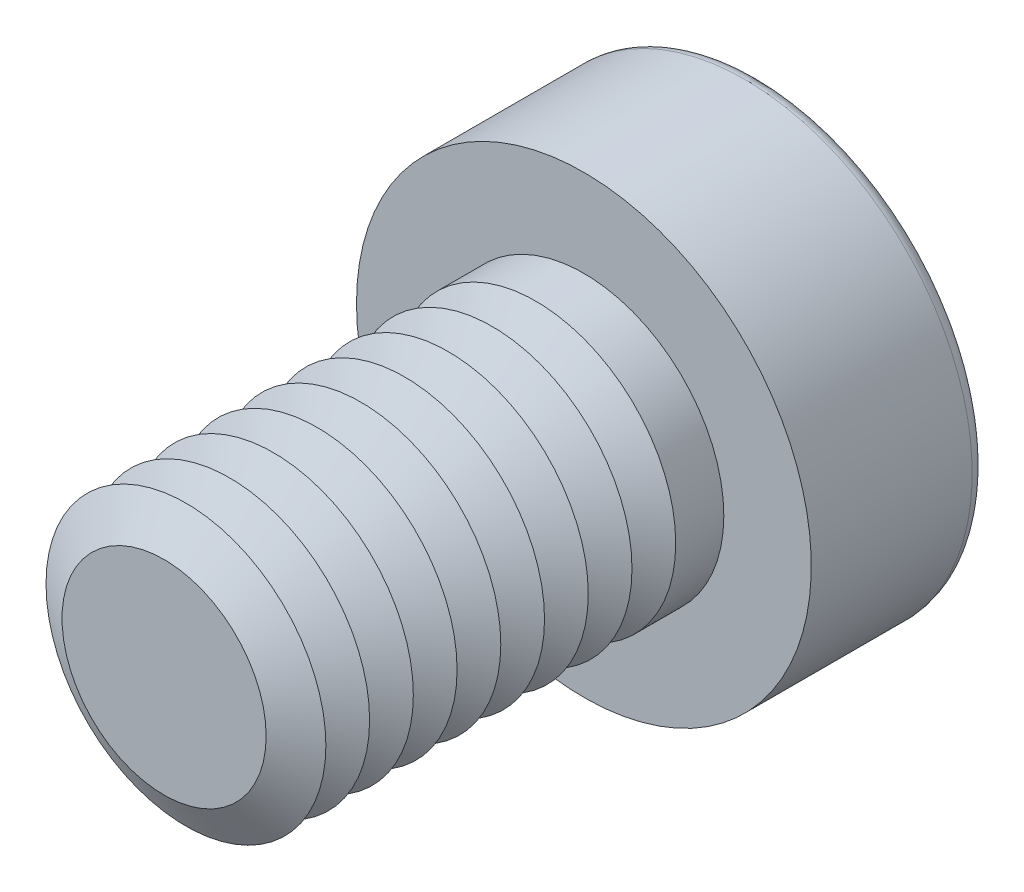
from build123d import *

# Parameters (mm, degrees)
SKETCH1_R           = 4
BOSS_EXTRUDE1_DEPTH = 12
SKETCH2_R           = 6.5
BOSS_EXTRUDE2_DEPTH = 5
CUT_EXTRUDE1_DEPTH  = 3.75
FILLET1_R           = 0.4
LPATTERN1_COUNT     = 9
LPATTERN1_PITCH     = 1.25


with BuildPart() as part:
    # Sketch1 → Boss-Extrude1 (new body)
    with BuildSketch(Plane.XY):
        Circle(SKETCH1_R)
    extrude(amount=BOSS_EXTRUDE1_DEPTH)

    # Sketch2 → Boss-Extrude2 (add)
    with BuildSketch(Plane(origin=(0, 0, 0), x_dir=(-1, 0, 0), z_dir=(0, 0, -1))):
        Circle(SKETCH2_R)
    extrude(amount=BOSS_EXTRUDE2_DEPTH)

    # Sketch3 → Cut-Extrude1 (cut)
    with BuildSketch(Plane(origin=(0, 0, -5), x_dir=(-1, 0, 0), z_dir=(0, 0, -1))):
        Polygon((-1.443375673, 2.5), (-2.886751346, 0), (-1.443375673, -2.5), (1.443375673, -2.5), (2.886751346, 0), (1.443375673, 2.5), align=None)
    extrude(amount=-CUT_EXTRUDE1_DEPTH, mode=Mode.SUBTRACT)

    # Fillet1
    fillet1_edges = [part.edges().sort_by_distance(p)[0] for p in [
        (6.5, 0, -5),
    ]]
    fillet(fillet1_edges, radius=FILLET1_R)

    # Cut-Extrude2 cone 1 section (on through the dimple's axis) → Cut-Extrude2 (revolve, cut)
    with BuildSketch(Plane(origin=(0, 0, -1.25), x_dir=(0, 1, 0), z_dir=(1, 0, 0))):
        Polygon((0, 0), (2.5, 0), (0, 1.443375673), align=None)
    revolve(axis=Axis((0, 0, -1.25), (0, 0, 1)), mode=Mode.SUBTRACT)

    # Cut-Extrude3 cone 1 section (on through the dimple's axis) → Cut-Extrude3 (revolve, cut)
    with BuildSketch(Plane(origin=(0, 0, -5), x_dir=(0, 1, 0), z_dir=(1, 0, 0))):
        Polygon((0, 0), (2.886751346, 0), (0, 0.773502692), align=None)
    revolve(axis=Axis((0, 0, -5), (0, 0, 1)), mode=Mode.SUBTRACT)

    # Sketch7 → Cut-Revolve1 (revolve, cut)
    with BuildSketch(Plane(origin=(0, 0, 0), x_dir=(0, 0, -1), z_dir=(1, 0, 0)), mode=Mode.PRIVATE) as cut_revolve1_sk:
        Polygon((-12, 2.917468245), (-11.375, 4), (-12.625, 4), align=None)
    cut_revolve1 = revolve(cut_revolve1_sk.sketch.rotate(Axis((0, 0, 12), (0, 0, -1)), 90), axis=Axis((0, 0, 12), (0, 0, -1)), mode=Mode.SUBTRACT)

    # LPattern1: Cut-Revolve1 ×9
    with Locations(*[(0, 0, -i * LPATTERN1_PITCH) for i in range(1, LPATTERN1_COUNT)]):
        add(cut_revolve1, mode=Mode.SUBTRACT)


solid = part.part
